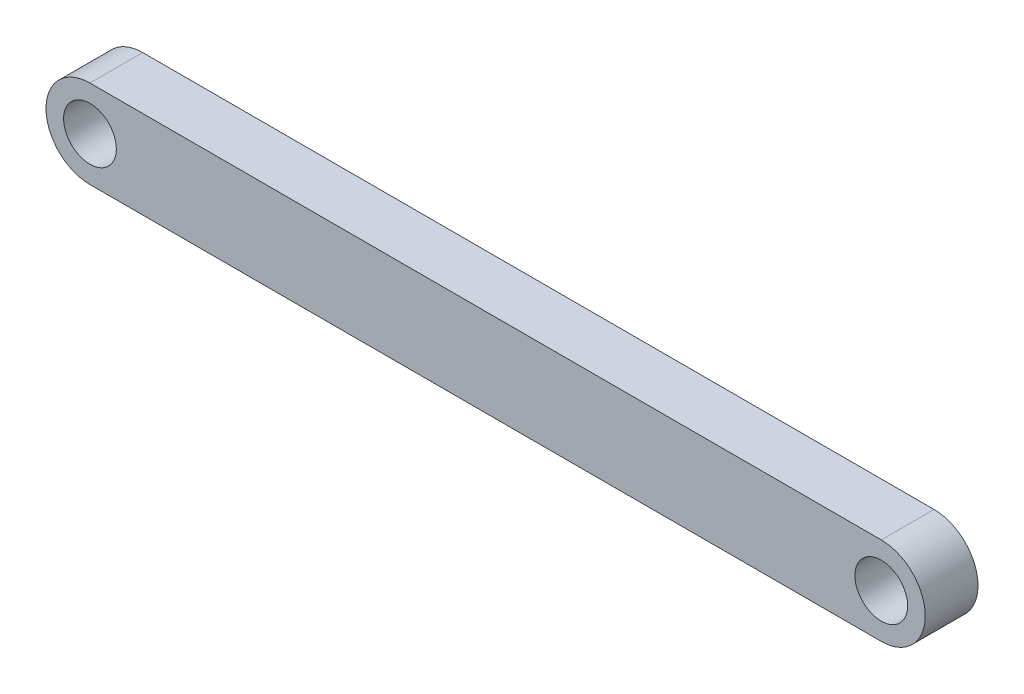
ISO-10303-21;
HEADER;
FILE_DESCRIPTION(('STEP AP214'),'2;1');
FILE_NAME('part.step','',(''),(''),'','','');
FILE_SCHEMA(('AUTOMOTIVE_DESIGN { 1 0 10303 214 1 1 1 1 }'));
ENDSEC;
DATA;
#1=APPLICATION_CONTEXT('core data for automotive mechanical design processes');
#2=APPLICATION_PROTOCOL_DEFINITION('international standard','automotive_design',2000,#1);
#3=PRODUCT_CONTEXT('',#1,'mechanical');
#4=PRODUCT('Part','Part','',(#3));
#5=PRODUCT_RELATED_PRODUCT_CATEGORY('part','',(#4));
#6=PRODUCT_DEFINITION_FORMATION('','',#4);
#7=PRODUCT_DEFINITION_CONTEXT('part definition',#1,'design');
#8=PRODUCT_DEFINITION('design','',#6,#7);
#9=PRODUCT_DEFINITION_SHAPE('','',#8);
#10=(LENGTH_UNIT() NAMED_UNIT(*) SI_UNIT(.MILLI.,.METRE.));
#11=(NAMED_UNIT(*) PLANE_ANGLE_UNIT() SI_UNIT($,.RADIAN.));
#12=(NAMED_UNIT(*) SI_UNIT($,.STERADIAN.) SOLID_ANGLE_UNIT());
#13=UNCERTAINTY_MEASURE_WITH_UNIT(LENGTH_MEASURE(1.E-05),#10,'distance_accuracy_value','');
#14=(GEOMETRIC_REPRESENTATION_CONTEXT(3) GLOBAL_UNCERTAINTY_ASSIGNED_CONTEXT((#13)) GLOBAL_UNIT_ASSIGNED_CONTEXT((#10,
#11,#12)) REPRESENTATION_CONTEXT('',''));
#15=CARTESIAN_POINT('',(0.,0.,0.));
#16=DIRECTION('',(0.,0.,1.));
#17=DIRECTION('',(1.,0.,0.));
#18=AXIS2_PLACEMENT_3D('',#15,#16,#17);
#19=CARTESIAN_POINT('',(2.5,0.,-1.5));
#20=DIRECTION('',(0.,0.,-1.));
#21=DIRECTION('',(-1.,0.,0.));
#22=AXIS2_PLACEMENT_3D('',#19,#20,#21);
#23=CYLINDRICAL_SURFACE('',#22,2.5);
#24=DIRECTION('',(0.,0.,-1.));
#25=VECTOR('',#24,1.);
#26=CARTESIAN_POINT('',(2.5,2.5,1.5));
#27=LINE('',#26,#25);
#28=CARTESIAN_POINT('',(2.5,2.5,-1.5));
#29=VERTEX_POINT('',#28);
#30=CARTESIAN_POINT('',(2.5,2.5,1.5));
#31=VERTEX_POINT('',#30);
#32=EDGE_CURVE('E82',#29,#31,#27,.F.);
#33=ORIENTED_EDGE('',*,*,#32,.F.);
#34=CARTESIAN_POINT('',(2.5,0.,-1.5));
#35=DIRECTION('',(0.,0.,1.));
#36=DIRECTION('',(1.,0.,0.));
#37=AXIS2_PLACEMENT_3D('',#34,#35,#36);
#38=CIRCLE('',#37,2.5);
#39=CARTESIAN_POINT('',(2.5,-2.5,-1.5));
#40=VERTEX_POINT('',#39);
#41=EDGE_CURVE('E40',#40,#29,#38,.F.);
#42=ORIENTED_EDGE('',*,*,#41,.F.);
#43=DIRECTION('',(0.,0.,-1.));
#44=VECTOR('',#43,1.);
#45=CARTESIAN_POINT('',(2.5,-2.5,1.5));
#46=LINE('',#45,#44);
#47=CARTESIAN_POINT('',(2.5,-2.5,1.5));
#48=VERTEX_POINT('',#47);
#49=EDGE_CURVE('E105',#48,#40,#46,.T.);
#50=ORIENTED_EDGE('',*,*,#49,.F.);
#51=CARTESIAN_POINT('',(2.5,0.,1.5));
#52=DIRECTION('',(0.,0.,1.));
#53=DIRECTION('',(1.,0.,0.));
#54=AXIS2_PLACEMENT_3D('',#51,#52,#53);
#55=CIRCLE('',#54,2.5);
#56=EDGE_CURVE('E11',#31,#48,#55,.T.);
#57=ORIENTED_EDGE('',*,*,#56,.F.);
#58=EDGE_LOOP('',(#33,#42,#50,#57));
#59=FACE_BOUND('',#58,.T.);
#60=ADVANCED_FACE('F33',(#59),#23,.T.);
#61=CARTESIAN_POINT('',(47.5,0.,1.5));
#62=DIRECTION('',(0.,0.,-1.));
#63=DIRECTION('',(-1.,0.,0.));
#64=AXIS2_PLACEMENT_3D('',#61,#62,#63);
#65=CYLINDRICAL_SURFACE('',#64,2.5);
#66=DIRECTION('',(0.,0.,-1.));
#67=VECTOR('',#66,1.);
#68=CARTESIAN_POINT('',(47.5,2.5,1.5));
#69=LINE('',#68,#67);
#70=CARTESIAN_POINT('',(47.5,2.5,1.5));
#71=VERTEX_POINT('',#70);
#72=CARTESIAN_POINT('',(47.5,2.5,-1.5));
#73=VERTEX_POINT('',#72);
#74=EDGE_CURVE('E75',#71,#73,#69,.T.);
#75=ORIENTED_EDGE('',*,*,#74,.F.);
#76=CARTESIAN_POINT('',(47.5,0.,1.5));
#77=DIRECTION('',(0.,0.,1.));
#78=DIRECTION('',(1.,0.,0.));
#79=AXIS2_PLACEMENT_3D('',#76,#77,#78);
#80=CIRCLE('',#79,2.5);
#81=CARTESIAN_POINT('',(47.5,-2.5,1.5));
#82=VERTEX_POINT('',#81);
#83=EDGE_CURVE('E83',#82,#71,#80,.T.);
#84=ORIENTED_EDGE('',*,*,#83,.F.);
#85=DIRECTION('',(0.,0.,-1.));
#86=VECTOR('',#85,1.);
#87=CARTESIAN_POINT('',(47.5,-2.5,1.5));
#88=LINE('',#87,#86);
#89=CARTESIAN_POINT('',(47.5,-2.5,-1.5));
#90=VERTEX_POINT('',#89);
#91=EDGE_CURVE('E78',#90,#82,#88,.F.);
#92=ORIENTED_EDGE('',*,*,#91,.F.);
#93=CARTESIAN_POINT('',(47.5,0.,-1.5));
#94=DIRECTION('',(0.,0.,1.));
#95=DIRECTION('',(1.,0.,0.));
#96=AXIS2_PLACEMENT_3D('',#93,#94,#95);
#97=CIRCLE('',#96,2.5);
#98=EDGE_CURVE('E71',#73,#90,#97,.F.);
#99=ORIENTED_EDGE('',*,*,#98,.F.);
#100=EDGE_LOOP('',(#75,#84,#92,#99));
#101=FACE_BOUND('',#100,.T.);
#102=ADVANCED_FACE('F73',(#101),#65,.T.);
#103=CARTESIAN_POINT('',(0.,-2.5,1.5));
#104=DIRECTION('',(0.,1.,0.));
#105=DIRECTION('',(0.,0.,1.));
#106=AXIS2_PLACEMENT_3D('',#103,#104,#105);
#107=PLANE('',#106);
#108=DIRECTION('',(1.,0.,0.));
#109=VECTOR('',#108,1.);
#110=CARTESIAN_POINT('',(0.,-2.5,1.5));
#111=LINE('',#110,#109);
#112=EDGE_CURVE('E93',#48,#82,#111,.T.);
#113=ORIENTED_EDGE('',*,*,#112,.F.);
#114=ORIENTED_EDGE('',*,*,#49,.T.);
#115=DIRECTION('',(1.,0.,0.));
#116=VECTOR('',#115,1.);
#117=CARTESIAN_POINT('',(0.,-2.5,-1.5));
#118=LINE('',#117,#116);
#119=EDGE_CURVE('E94',#40,#90,#118,.T.);
#120=ORIENTED_EDGE('',*,*,#119,.T.);
#121=ORIENTED_EDGE('',*,*,#91,.T.);
#122=EDGE_LOOP('',(#113,#114,#120,#121));
#123=FACE_BOUND('',#122,.T.);
#124=ADVANCED_FACE('F108',(#123),#107,.F.);
#125=CARTESIAN_POINT('',(0.,2.5,1.5));
#126=DIRECTION('',(0.,-1.,0.));
#127=DIRECTION('',(0.,0.,-1.));
#128=AXIS2_PLACEMENT_3D('',#125,#126,#127);
#129=PLANE('',#128);
#130=DIRECTION('',(-1.,0.,0.));
#131=VECTOR('',#130,1.);
#132=CARTESIAN_POINT('',(0.,2.5,-1.5));
#133=LINE('',#132,#131);
#134=EDGE_CURVE('E89',#73,#29,#133,.T.);
#135=ORIENTED_EDGE('',*,*,#134,.T.);
#136=ORIENTED_EDGE('',*,*,#32,.T.);
#137=DIRECTION('',(-1.,0.,0.));
#138=VECTOR('',#137,1.);
#139=CARTESIAN_POINT('',(0.,2.5,1.5));
#140=LINE('',#139,#138);
#141=EDGE_CURVE('E90',#71,#31,#140,.T.);
#142=ORIENTED_EDGE('',*,*,#141,.F.);
#143=ORIENTED_EDGE('',*,*,#74,.T.);
#144=EDGE_LOOP('',(#135,#136,#142,#143));
#145=FACE_BOUND('',#144,.T.);
#146=ADVANCED_FACE('F87',(#145),#129,.F.);
#147=CARTESIAN_POINT('',(0.,-2.5,1.5));
#148=DIRECTION('',(0.,0.,1.));
#149=DIRECTION('',(1.,0.,0.));
#150=AXIS2_PLACEMENT_3D('',#147,#148,#149);
#151=PLANE('',#150);
#152=CARTESIAN_POINT('',(47.5,0.,1.5));
#153=DIRECTION('',(0.,0.,1.));
#154=DIRECTION('',(1.,0.,0.));
#155=AXIS2_PLACEMENT_3D('',#152,#153,#154);
#156=CIRCLE('',#155,1.5);
#157=CARTESIAN_POINT('',(49.,0.,1.5));
#158=VERTEX_POINT('',#157);
#159=EDGE_CURVE('E177',#158,#158,#156,.T.);
#160=ORIENTED_EDGE('',*,*,#159,.F.);
#161=EDGE_LOOP('',(#160));
#162=FACE_BOUND('',#161,.T.);
#163=CARTESIAN_POINT('',(2.5,0.,1.5));
#164=DIRECTION('',(0.,0.,1.));
#165=DIRECTION('',(1.,0.,0.));
#166=AXIS2_PLACEMENT_3D('',#163,#164,#165);
#167=CIRCLE('',#166,1.5);
#168=CARTESIAN_POINT('',(4.,0.,1.5));
#169=VERTEX_POINT('',#168);
#170=EDGE_CURVE('E179',#169,#169,#167,.T.);
#171=ORIENTED_EDGE('',*,*,#170,.F.);
#172=EDGE_LOOP('',(#171));
#173=FACE_BOUND('',#172,.T.);
#174=ORIENTED_EDGE('',*,*,#141,.T.);
#175=ORIENTED_EDGE('',*,*,#56,.T.);
#176=ORIENTED_EDGE('',*,*,#112,.T.);
#177=ORIENTED_EDGE('',*,*,#83,.T.);
#178=EDGE_LOOP('',(#174,#175,#176,#177));
#179=FACE_BOUND('',#178,.T.);
#180=ADVANCED_FACE('F109',(#162,#173,#179),#151,.T.);
#181=CARTESIAN_POINT('',(0.,-2.5,-1.5));
#182=DIRECTION('',(0.,0.,1.));
#183=DIRECTION('',(1.,0.,0.));
#184=AXIS2_PLACEMENT_3D('',#181,#182,#183);
#185=PLANE('',#184);
#186=CARTESIAN_POINT('',(47.5,0.,-1.5));
#187=DIRECTION('',(0.,0.,1.));
#188=DIRECTION('',(1.,0.,0.));
#189=AXIS2_PLACEMENT_3D('',#186,#187,#188);
#190=CIRCLE('',#189,1.5);
#191=CARTESIAN_POINT('',(49.,0.,-1.5));
#192=VERTEX_POINT('',#191);
#193=EDGE_CURVE('E175',#192,#192,#190,.T.);
#194=ORIENTED_EDGE('',*,*,#193,.T.);
#195=EDGE_LOOP('',(#194));
#196=FACE_BOUND('',#195,.T.);
#197=CARTESIAN_POINT('',(2.5,0.,-1.5));
#198=DIRECTION('',(0.,0.,1.));
#199=DIRECTION('',(1.,0.,0.));
#200=AXIS2_PLACEMENT_3D('',#197,#198,#199);
#201=CIRCLE('',#200,1.5);
#202=CARTESIAN_POINT('',(4.,0.,-1.5));
#203=VERTEX_POINT('',#202);
#204=EDGE_CURVE('E97',#203,#203,#201,.T.);
#205=ORIENTED_EDGE('',*,*,#204,.T.);
#206=EDGE_LOOP('',(#205));
#207=FACE_BOUND('',#206,.T.);
#208=ORIENTED_EDGE('',*,*,#119,.F.);
#209=ORIENTED_EDGE('',*,*,#41,.T.);
#210=ORIENTED_EDGE('',*,*,#134,.F.);
#211=ORIENTED_EDGE('',*,*,#98,.T.);
#212=EDGE_LOOP('',(#208,#209,#210,#211));
#213=FACE_BOUND('',#212,.T.);
#214=ADVANCED_FACE('F92',(#196,#207,#213),#185,.F.);
#215=CARTESIAN_POINT('',(2.5,0.,-1.5));
#216=DIRECTION('',(0.,0.,1.));
#217=DIRECTION('',(1.,0.,0.));
#218=AXIS2_PLACEMENT_3D('',#215,#216,#217);
#219=CYLINDRICAL_SURFACE('',#218,1.5);
#220=ORIENTED_EDGE('',*,*,#204,.F.);
#221=EDGE_LOOP('',(#220));
#222=FACE_BOUND('',#221,.T.);
#223=ORIENTED_EDGE('',*,*,#170,.T.);
#224=EDGE_LOOP('',(#223));
#225=FACE_BOUND('',#224,.T.);
#226=ADVANCED_FACE('F117',(#222,#225),#219,.F.);
#227=CARTESIAN_POINT('',(47.5,0.,-1.5));
#228=DIRECTION('',(0.,0.,1.));
#229=DIRECTION('',(1.,0.,0.));
#230=AXIS2_PLACEMENT_3D('',#227,#228,#229);
#231=CYLINDRICAL_SURFACE('',#230,1.5);
#232=ORIENTED_EDGE('',*,*,#193,.F.);
#233=EDGE_LOOP('',(#232));
#234=FACE_BOUND('',#233,.T.);
#235=ORIENTED_EDGE('',*,*,#159,.T.);
#236=EDGE_LOOP('',(#235));
#237=FACE_BOUND('',#236,.T.);
#238=ADVANCED_FACE('F157',(#234,#237),#231,.F.);
#239=CLOSED_SHELL('',(#60,#102,#124,#146,#180,#214,#226,#238));
#240=MANIFOLD_SOLID_BREP('B2',#239);
#241=ADVANCED_BREP_SHAPE_REPRESENTATION('',(#18,#240),#14);
#242=SHAPE_DEFINITION_REPRESENTATION(#9,#241);
ENDSEC;
END-ISO-10303-21;
